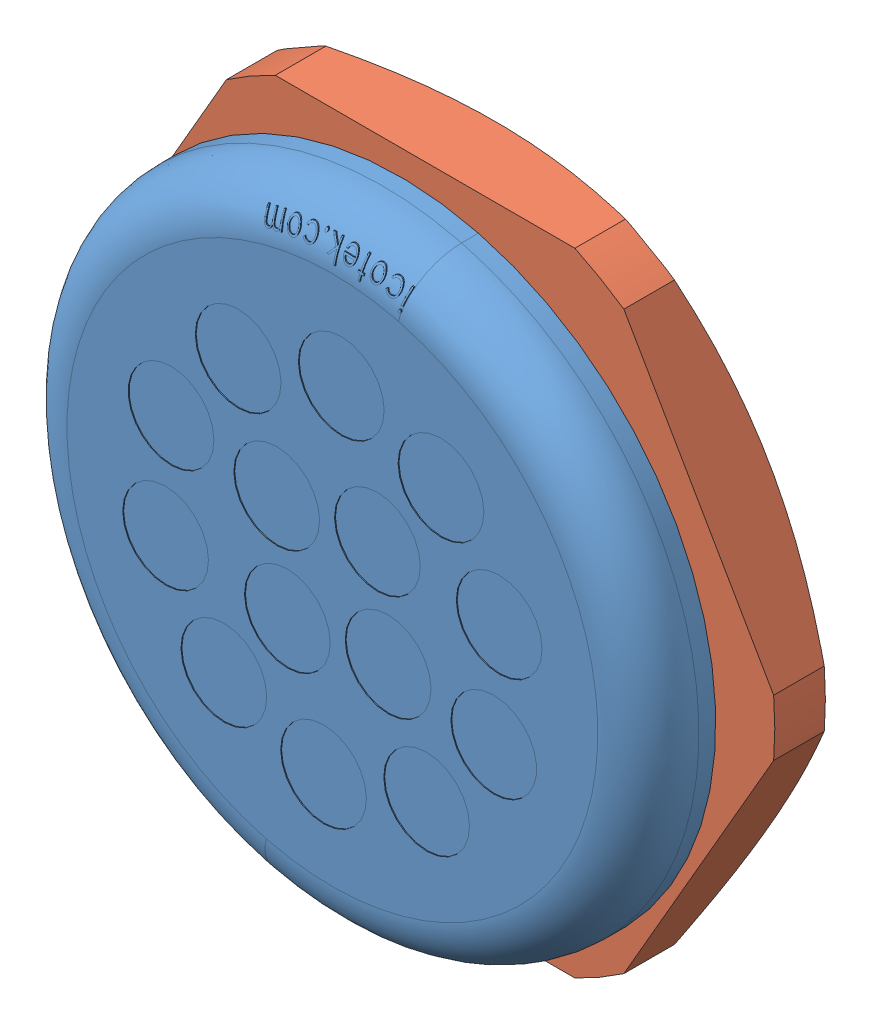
SolidWorks assembly 70361.SLDASM, configuration Default (file format 8000). Lengths in mm.
Overall size (83 83.01 22.04).
2 component instances, 2 part files, 0 mates.
Components (placement in the parent):
- 70361_01-1: 70361_01.SLDPRT [Default] at origin size (75 75 22.04)
- 70361_02-1: 70361_02.SLDPRT [Default] at origin size (83 83.01 8.6)
